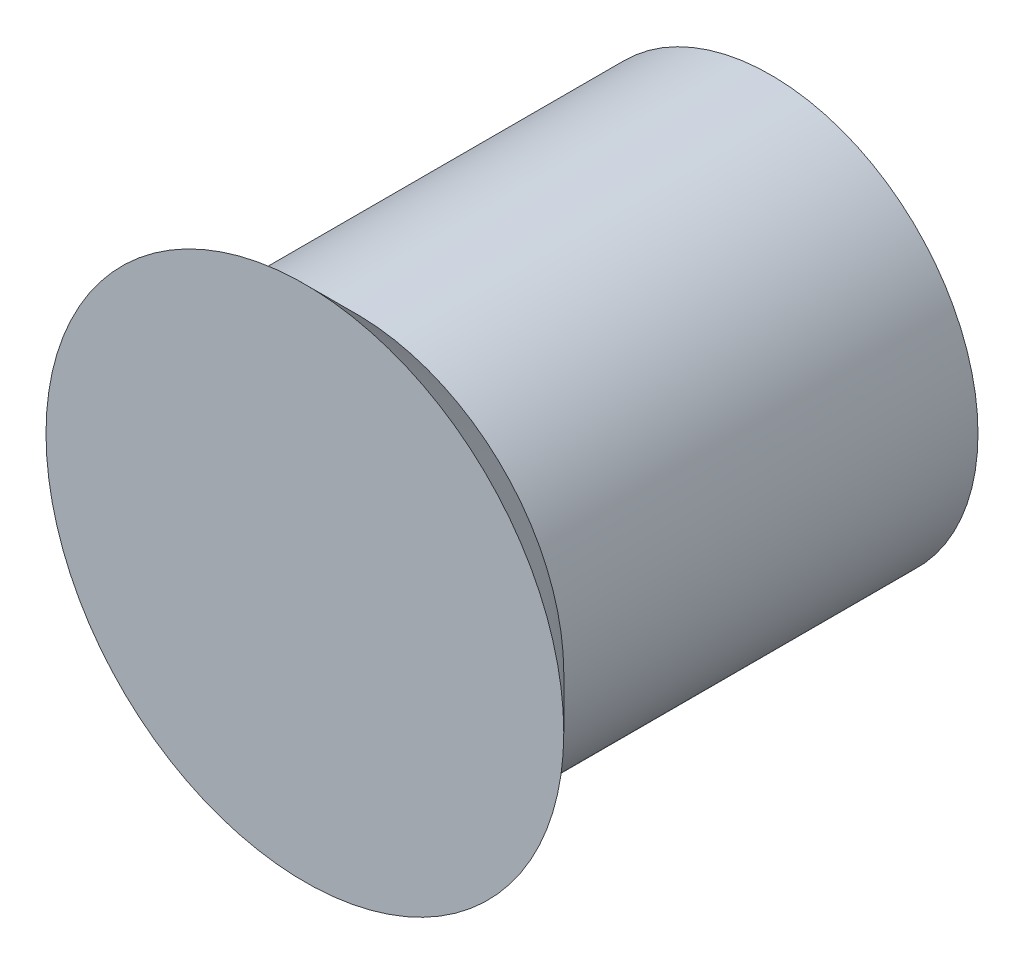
from build123d import *

# Parameters (mm, degrees)
IZIM1_R                     = 4
Y_KSEKLIK_EKSTR_ZYON1_DEPTH = 8
IZIM2_R                     = 4
Y_KSEKLIK_EKSTR_ZYON2_DEPTH = 1
Y_KSEKLIK_EKSTR_ZYON2_DRAFT = -45


with BuildPart() as part:
    # izim1 → Y_kseklik-Ekstr_zyon1 (new body)
    with BuildSketch(Plane.XY):
        Circle(IZIM1_R)
    extrude(amount=Y_KSEKLIK_EKSTR_ZYON1_DEPTH)


with BuildPart() as y_kseklik_ekstr_zyon2_tool:
    # izim2 → Y_kseklik-Ekstr_zyon2 (with draft: the straight prism first)
    with BuildSketch(Plane.XY.offset(8)):
        Circle(IZIM2_R)
    extrude(amount=Y_KSEKLIK_EKSTR_ZYON2_DEPTH)
    # Y_kseklik-Ekstr_zyon2: the draft: its side faces are tilted about the plane it starts from
    y_kseklik_ekstr_zyon2_sides = [y_kseklik_ekstr_zyon2_tool.faces().sort_by_distance(p)[0] for p in [
        (-4, 0, 8.5),
    ]]
    draft(y_kseklik_ekstr_zyon2_sides, Plane.XY.offset(8), Y_KSEKLIK_EKSTR_ZYON2_DRAFT)


with BuildPart() as part_1:
    add(part.part)

    # Y_kseklik-Ekstr_zyon2: add y_kseklik_ekstr_zyon2_tool
    add(y_kseklik_ekstr_zyon2_tool.part)


solid = part_1.part
